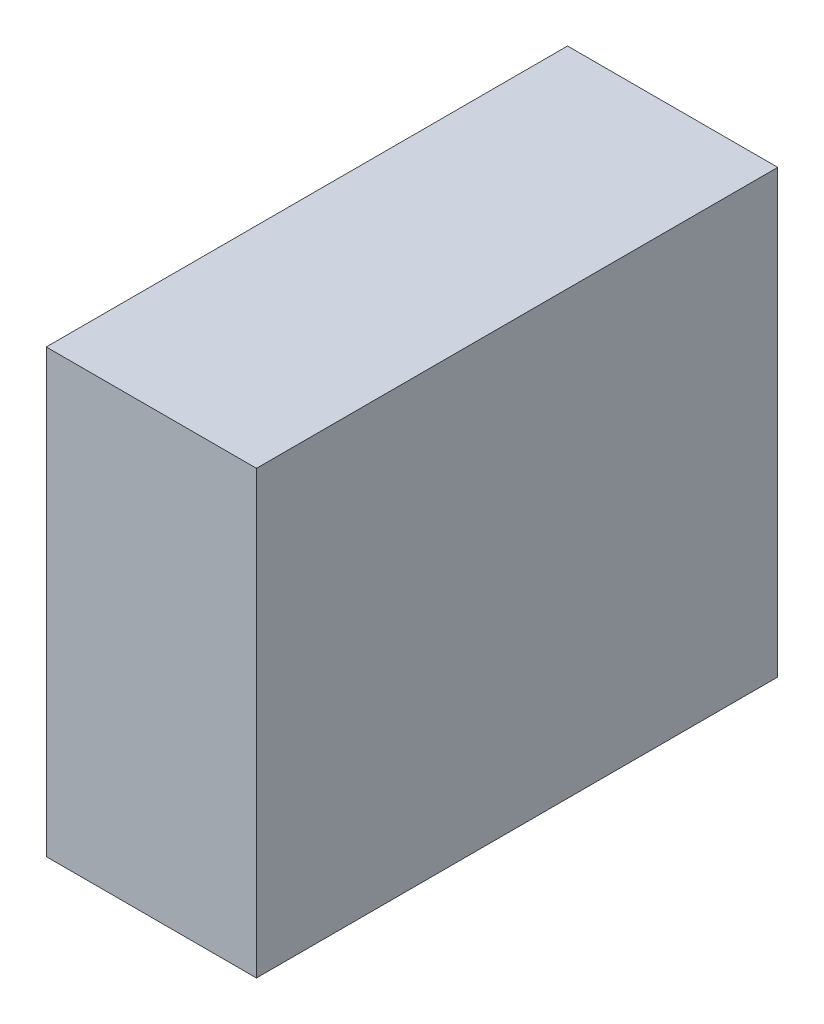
from build123d import *

# Parameters (mm, degrees)
SKETCH1_W      = 50
SKETCH1_H      = 124
EXTRUDE1_DEPTH = 105


with BuildPart() as part:
    # Sketch1 → Extrude1 (new body)
    with BuildSketch(Plane(origin=(0, 0, 0), x_dir=(1, 0, 0), z_dir=(0, 1, 0))):
        Rectangle(SKETCH1_W, SKETCH1_H)
    extrude(amount=EXTRUDE1_DEPTH)


solid = part.part
